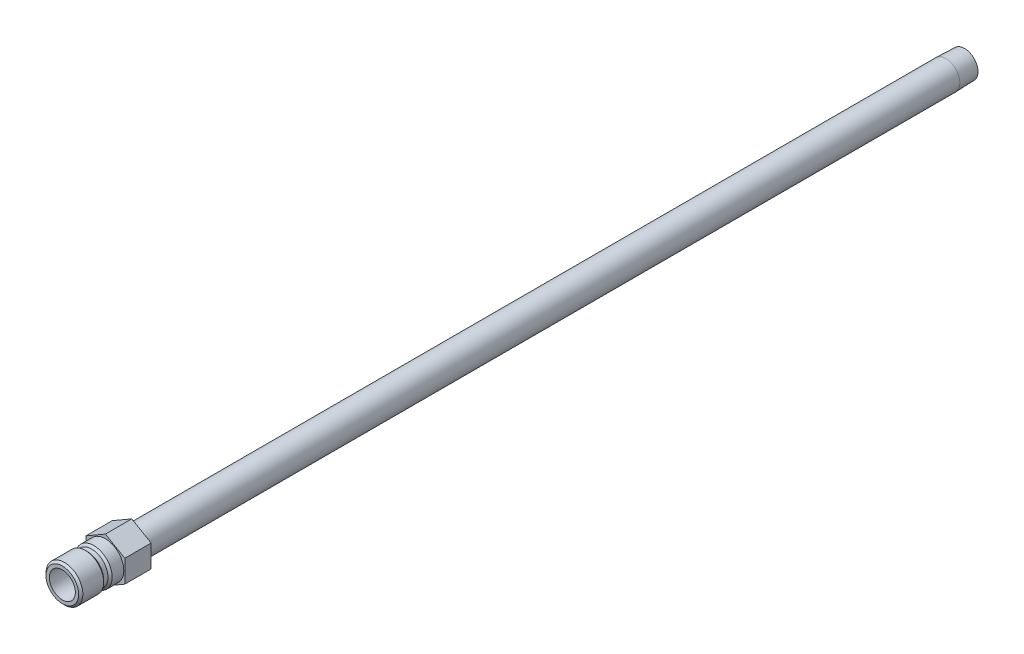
ISO-10303-21;
HEADER;
FILE_DESCRIPTION(('STEP AP214'),'2;1');
FILE_NAME('part.step','',(''),(''),'','','');
FILE_SCHEMA(('AUTOMOTIVE_DESIGN { 1 0 10303 214 1 1 1 1 }'));
ENDSEC;
DATA;
#1=APPLICATION_CONTEXT('core data for automotive mechanical design processes');
#2=APPLICATION_PROTOCOL_DEFINITION('international standard','automotive_design',2000,#1);
#3=PRODUCT_CONTEXT('',#1,'mechanical');
#4=PRODUCT('Part','Part','',(#3));
#5=PRODUCT_RELATED_PRODUCT_CATEGORY('part','',(#4));
#6=PRODUCT_DEFINITION_FORMATION('','',#4);
#7=PRODUCT_DEFINITION_CONTEXT('part definition',#1,'design');
#8=PRODUCT_DEFINITION('design','',#6,#7);
#9=PRODUCT_DEFINITION_SHAPE('','',#8);
#10=(LENGTH_UNIT() NAMED_UNIT(*) SI_UNIT(.MILLI.,.METRE.));
#11=(NAMED_UNIT(*) PLANE_ANGLE_UNIT() SI_UNIT($,.RADIAN.));
#12=(NAMED_UNIT(*) SI_UNIT($,.STERADIAN.) SOLID_ANGLE_UNIT());
#13=UNCERTAINTY_MEASURE_WITH_UNIT(LENGTH_MEASURE(1.E-05),#10,'distance_accuracy_value','');
#14=(GEOMETRIC_REPRESENTATION_CONTEXT(3) GLOBAL_UNCERTAINTY_ASSIGNED_CONTEXT((#13)) GLOBAL_UNIT_ASSIGNED_CONTEXT((#10,
#11,#12)) REPRESENTATION_CONTEXT('',''));
#15=CARTESIAN_POINT('',(0.,0.,0.));
#16=DIRECTION('',(0.,0.,1.));
#17=DIRECTION('',(1.,0.,0.));
#18=AXIS2_PLACEMENT_3D('',#15,#16,#17);
#19=CARTESIAN_POINT('',(0.,0.,-9.652));
#20=DIRECTION('',(0.,0.,-1.));
#21=DIRECTION('',(0.,1.,0.));
#22=AXIS2_PLACEMENT_3D('',#19,#20,#21);
#23=CYLINDRICAL_SURFACE('',#22,4.7625);
#24=CARTESIAN_POINT('',(0.,0.,3.556));
#25=DIRECTION('',(0.,0.,-1.));
#26=DIRECTION('',(0.,1.,0.));
#27=AXIS2_PLACEMENT_3D('',#24,#25,#26);
#28=CIRCLE('',#27,4.7625);
#29=CARTESIAN_POINT('',(0.,4.7625,3.556));
#30=VERTEX_POINT('',#29);
#31=EDGE_CURVE('E137',#30,#30,#28,.T.);
#32=ORIENTED_EDGE('',*,*,#31,.T.);
#33=EDGE_LOOP('',(#32));
#34=FACE_BOUND('',#33,.T.);
#35=CARTESIAN_POINT('',(0.,0.,15.748));
#36=DIRECTION('',(0.,0.,-1.));
#37=DIRECTION('',(0.,1.,0.));
#38=AXIS2_PLACEMENT_3D('',#35,#36,#37);
#39=CIRCLE('',#38,4.7625);
#40=CARTESIAN_POINT('',(0.,4.7625,15.748));
#41=VERTEX_POINT('',#40);
#42=EDGE_CURVE('E41',#41,#41,#39,.T.);
#43=ORIENTED_EDGE('',*,*,#42,.F.);
#44=EDGE_LOOP('',(#43));
#45=FACE_BOUND('',#44,.T.);
#46=ADVANCED_FACE('F33',(#34,#45),#23,.F.);
#47=CARTESIAN_POINT('',(0.,4.7625,15.748));
#48=DIRECTION('',(0.,0.,1.));
#49=DIRECTION('',(0.,-1.,0.));
#50=AXIS2_PLACEMENT_3D('',#47,#48,#49);
#51=PLANE('',#50);
#52=ORIENTED_EDGE('',*,*,#42,.T.);
#53=EDGE_LOOP('',(#52));
#54=FACE_BOUND('',#53,.T.);
#55=CARTESIAN_POINT('',(0.,0.,15.748));
#56=DIRECTION('',(0.,0.,-1.));
#57=DIRECTION('',(0.,1.,0.));
#58=AXIS2_PLACEMENT_3D('',#55,#56,#57);
#59=CIRCLE('',#58,5.9817);
#60=CARTESIAN_POINT('',(0.,5.9817,15.748));
#61=VERTEX_POINT('',#60);
#62=EDGE_CURVE('E175',#61,#61,#59,.T.);
#63=ORIENTED_EDGE('',*,*,#62,.F.);
#64=EDGE_LOOP('',(#63));
#65=FACE_BOUND('',#64,.T.);
#66=ADVANCED_FACE('F180',(#54,#65),#51,.T.);
#67=CARTESIAN_POINT('',(0.,0.,14.986));
#68=DIRECTION('',(0.,0.,-1.));
#69=DIRECTION('',(0.,1.,0.));
#70=AXIS2_PLACEMENT_3D('',#67,#68,#69);
#71=CONICAL_SURFACE('',#70,6.7437,0.785398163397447);
#72=ORIENTED_EDGE('',*,*,#62,.T.);
#73=EDGE_LOOP('',(#72));
#74=FACE_BOUND('',#73,.T.);
#75=CARTESIAN_POINT('',(0.,0.,14.986));
#76=DIRECTION('',(0.,0.,-1.));
#77=DIRECTION('',(0.,1.,0.));
#78=AXIS2_PLACEMENT_3D('',#75,#76,#77);
#79=CIRCLE('',#78,6.7437);
#80=CARTESIAN_POINT('',(0.,6.7437,14.986));
#81=VERTEX_POINT('',#80);
#82=EDGE_CURVE('E172',#81,#81,#79,.T.);
#83=ORIENTED_EDGE('',*,*,#82,.F.);
#84=EDGE_LOOP('',(#83));
#85=FACE_BOUND('',#84,.T.);
#86=ADVANCED_FACE('F188',(#74,#85),#71,.T.);
#87=CARTESIAN_POINT('',(0.,0.,-9.652));
#88=DIRECTION('',(0.,0.,-1.));
#89=DIRECTION('',(0.,1.,0.));
#90=AXIS2_PLACEMENT_3D('',#87,#88,#89);
#91=CYLINDRICAL_SURFACE('',#90,6.7437);
#92=ORIENTED_EDGE('',*,*,#82,.T.);
#93=EDGE_LOOP('',(#92));
#94=FACE_BOUND('',#93,.T.);
#95=CARTESIAN_POINT('',(0.,0.,7.366));
#96=DIRECTION('',(0.,0.,-1.));
#97=DIRECTION('',(0.,1.,0.));
#98=AXIS2_PLACEMENT_3D('',#95,#96,#97);
#99=CIRCLE('',#98,6.7437);
#100=CARTESIAN_POINT('',(0.,6.7437,7.366));
#101=VERTEX_POINT('',#100);
#102=EDGE_CURVE('E169',#101,#101,#99,.T.);
#103=ORIENTED_EDGE('',*,*,#102,.F.);
#104=EDGE_LOOP('',(#103));
#105=FACE_BOUND('',#104,.T.);
#106=ADVANCED_FACE('F237',(#94,#105),#91,.T.);
#107=CARTESIAN_POINT('',(0.,0.,6.604));
#108=DIRECTION('',(0.,0.,1.));
#109=DIRECTION('',(0.,-1.,0.));
#110=AXIS2_PLACEMENT_3D('',#107,#108,#109);
#111=CONICAL_SURFACE('',#110,5.9817,0.785398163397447);
#112=ORIENTED_EDGE('',*,*,#102,.T.);
#113=EDGE_LOOP('',(#112));
#114=FACE_BOUND('',#113,.T.);
#115=CARTESIAN_POINT('',(0.,0.,6.604));
#116=DIRECTION('',(0.,0.,-1.));
#117=DIRECTION('',(0.,1.,0.));
#118=AXIS2_PLACEMENT_3D('',#115,#116,#117);
#119=CIRCLE('',#118,5.9817);
#120=CARTESIAN_POINT('',(0.,5.9817,6.604));
#121=VERTEX_POINT('',#120);
#122=EDGE_CURVE('E166',#121,#121,#119,.T.);
#123=ORIENTED_EDGE('',*,*,#122,.F.);
#124=EDGE_LOOP('',(#123));
#125=FACE_BOUND('',#124,.T.);
#126=ADVANCED_FACE('F233',(#114,#125),#111,.T.);
#127=CARTESIAN_POINT('',(0.,0.,-9.652));
#128=DIRECTION('',(0.,0.,-1.));
#129=DIRECTION('',(0.,1.,0.));
#130=AXIS2_PLACEMENT_3D('',#127,#128,#129);
#131=CYLINDRICAL_SURFACE('',#130,5.9817);
#132=ORIENTED_EDGE('',*,*,#122,.T.);
#133=EDGE_LOOP('',(#132));
#134=FACE_BOUND('',#133,.T.);
#135=CARTESIAN_POINT('',(0.,0.,5.0165));
#136=DIRECTION('',(0.,0.,-1.));
#137=DIRECTION('',(0.,1.,0.));
#138=AXIS2_PLACEMENT_3D('',#135,#136,#137);
#139=CIRCLE('',#138,5.9817);
#140=CARTESIAN_POINT('',(0.,5.9817,5.0165));
#141=VERTEX_POINT('',#140);
#142=EDGE_CURVE('E163',#141,#141,#139,.T.);
#143=ORIENTED_EDGE('',*,*,#142,.F.);
#144=EDGE_LOOP('',(#143));
#145=FACE_BOUND('',#144,.T.);
#146=ADVANCED_FACE('F229',(#134,#145),#131,.T.);
#147=CARTESIAN_POINT('',(0.,0.,4.2545));
#148=DIRECTION('',(0.,0.,-1.));
#149=DIRECTION('',(0.,1.,0.));
#150=AXIS2_PLACEMENT_3D('',#147,#148,#149);
#151=CONICAL_SURFACE('',#150,6.7437,0.785398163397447);
#152=ORIENTED_EDGE('',*,*,#142,.T.);
#153=EDGE_LOOP('',(#152));
#154=FACE_BOUND('',#153,.T.);
#155=CARTESIAN_POINT('',(0.,0.,4.2545));
#156=DIRECTION('',(0.,0.,-1.));
#157=DIRECTION('',(0.,1.,0.));
#158=AXIS2_PLACEMENT_3D('',#155,#156,#157);
#159=CIRCLE('',#158,6.7437);
#160=CARTESIAN_POINT('',(0.,6.7437,4.2545));
#161=VERTEX_POINT('',#160);
#162=EDGE_CURVE('E160',#161,#161,#159,.T.);
#163=ORIENTED_EDGE('',*,*,#162,.F.);
#164=EDGE_LOOP('',(#163));
#165=FACE_BOUND('',#164,.T.);
#166=ADVANCED_FACE('F225',(#154,#165),#151,.T.);
#167=CARTESIAN_POINT('',(0.,0.,-9.652));
#168=DIRECTION('',(0.,0.,-1.));
#169=DIRECTION('',(0.,1.,0.));
#170=AXIS2_PLACEMENT_3D('',#167,#168,#169);
#171=CYLINDRICAL_SURFACE('',#170,6.7437);
#172=CARTESIAN_POINT('',(0.,0.,0.));
#173=DIRECTION('',(0.,0.,1.));
#174=DIRECTION('',(1.,0.,0.));
#175=AXIS2_PLACEMENT_3D('',#172,#173,#174);
#176=CIRCLE('',#175,6.7437);
#177=CARTESIAN_POINT('',(6.7437,0.,0.));
#178=VERTEX_POINT('',#177);
#179=EDGE_CURVE('E11',#178,#178,#176,.F.);
#180=ORIENTED_EDGE('',*,*,#179,.F.);
#181=EDGE_LOOP('',(#180));
#182=FACE_BOUND('',#181,.T.);
#183=ORIENTED_EDGE('',*,*,#162,.T.);
#184=EDGE_LOOP('',(#183));
#185=FACE_BOUND('',#184,.T.);
#186=ADVANCED_FACE('F221',(#182,#185),#171,.T.);
#187=CARTESIAN_POINT('',(0.,6.7437,-9.652));
#188=DIRECTION('',(0.,0.,-1.));
#189=DIRECTION('',(0.,1.,0.));
#190=AXIS2_PLACEMENT_3D('',#187,#188,#189);
#191=PLANE('',#190);
#192=CARTESIAN_POINT('',(0.,0.,-9.652));
#193=DIRECTION('',(0.,0.,-1.));
#194=DIRECTION('',(0.,1.,0.));
#195=AXIS2_PLACEMENT_3D('',#192,#193,#194);
#196=CIRCLE('',#195,5.1435);
#197=CARTESIAN_POINT('',(0.,5.1435,-9.652));
#198=VERTEX_POINT('',#197);
#199=EDGE_CURVE('E157',#198,#198,#196,.T.);
#200=ORIENTED_EDGE('',*,*,#199,.F.);
#201=EDGE_LOOP('',(#200));
#202=FACE_BOUND('',#201,.T.);
#203=DIRECTION('',(-0.866025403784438,-0.5,0.));
#204=VECTOR('',#203,1.);
#205=CARTESIAN_POINT('',(0.,8.21223022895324,-9.652));
#206=LINE('',#205,#204);
#207=CARTESIAN_POINT('',(0.,8.21223022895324,-9.652));
#208=VERTEX_POINT('',#207);
#209=CARTESIAN_POINT('',(-7.112,4.10611511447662,-9.652));
#210=VERTEX_POINT('',#209);
#211=EDGE_CURVE('E135',#208,#210,#206,.T.);
#212=ORIENTED_EDGE('',*,*,#211,.F.);
#213=DIRECTION('',(-0.866025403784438,0.5,0.));
#214=VECTOR('',#213,1.);
#215=CARTESIAN_POINT('',(7.112,4.10611511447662,-9.652));
#216=LINE('',#215,#214);
#217=CARTESIAN_POINT('',(7.112,4.10611511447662,-9.652));
#218=VERTEX_POINT('',#217);
#219=EDGE_CURVE('E110',#218,#208,#216,.T.);
#220=ORIENTED_EDGE('',*,*,#219,.F.);
#221=DIRECTION('',(0.,1.,0.));
#222=VECTOR('',#221,1.);
#223=CARTESIAN_POINT('',(7.112,-4.10611511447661,-9.652));
#224=LINE('',#223,#222);
#225=CARTESIAN_POINT('',(7.112,-4.10611511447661,-9.652));
#226=VERTEX_POINT('',#225);
#227=EDGE_CURVE('E95',#226,#218,#224,.T.);
#228=ORIENTED_EDGE('',*,*,#227,.F.);
#229=DIRECTION('',(0.866025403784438,0.5,0.));
#230=VECTOR('',#229,1.);
#231=CARTESIAN_POINT('',(0.,-8.21223022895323,-9.652));
#232=LINE('',#231,#230);
#233=CARTESIAN_POINT('',(0.,-8.21223022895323,-9.652));
#234=VERTEX_POINT('',#233);
#235=EDGE_CURVE('E108',#234,#226,#232,.T.);
#236=ORIENTED_EDGE('',*,*,#235,.F.);
#237=DIRECTION('',(0.866025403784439,-0.5,0.));
#238=VECTOR('',#237,1.);
#239=CARTESIAN_POINT('',(-7.112,-4.10611511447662,-9.652));
#240=LINE('',#239,#238);
#241=CARTESIAN_POINT('',(-7.112,-4.10611511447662,-9.652));
#242=VERTEX_POINT('',#241);
#243=EDGE_CURVE('E113',#242,#234,#240,.T.);
#244=ORIENTED_EDGE('',*,*,#243,.F.);
#245=DIRECTION('',(0.,-1.,0.));
#246=VECTOR('',#245,1.);
#247=CARTESIAN_POINT('',(-7.112,4.10611511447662,-9.652));
#248=LINE('',#247,#246);
#249=EDGE_CURVE('E115',#210,#242,#248,.T.);
#250=ORIENTED_EDGE('',*,*,#249,.F.);
#251=EDGE_LOOP('',(#212,#220,#228,#236,#244,#250));
#252=FACE_BOUND('',#251,.T.);
#253=ADVANCED_FACE('F106',(#202,#252),#191,.T.);
#254=CARTESIAN_POINT('',(0.,0.,-9.652));
#255=DIRECTION('',(0.,0.,-1.));
#256=DIRECTION('',(0.,1.,0.));
#257=AXIS2_PLACEMENT_3D('',#254,#255,#256);
#258=CYLINDRICAL_SURFACE('',#257,5.14349999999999);
#259=ORIENTED_EDGE('',*,*,#199,.T.);
#260=EDGE_LOOP('',(#259));
#261=FACE_BOUND('',#260,.T.);
#262=CARTESIAN_POINT('',(0.,0.,-307.594));
#263=DIRECTION('',(0.,0.,-1.));
#264=DIRECTION('',(0.,1.,0.));
#265=AXIS2_PLACEMENT_3D('',#262,#263,#264);
#266=CIRCLE('',#265,5.14349999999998);
#267=CARTESIAN_POINT('',(0.,5.1435,-307.594));
#268=VERTEX_POINT('',#267);
#269=EDGE_CURVE('E154',#268,#268,#266,.T.);
#270=ORIENTED_EDGE('',*,*,#269,.F.);
#271=EDGE_LOOP('',(#270));
#272=FACE_BOUND('',#271,.T.);
#273=ADVANCED_FACE('F214',(#261,#272),#258,.T.);
#274=CARTESIAN_POINT('',(0.,0.,-314.452));
#275=DIRECTION('',(0.,0.,1.));
#276=DIRECTION('',(0.,-1.,0.));
#277=AXIS2_PLACEMENT_3D('',#274,#275,#276);
#278=CONICAL_SURFACE('',#277,4.92918877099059,0.0312396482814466);
#279=ORIENTED_EDGE('',*,*,#269,.T.);
#280=EDGE_LOOP('',(#279));
#281=FACE_BOUND('',#280,.T.);
#282=CARTESIAN_POINT('',(0.,0.,-314.452));
#283=DIRECTION('',(0.,0.,-1.));
#284=DIRECTION('',(0.,1.,0.));
#285=AXIS2_PLACEMENT_3D('',#282,#283,#284);
#286=CIRCLE('',#285,4.92918877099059);
#287=CARTESIAN_POINT('',(0.,4.9291887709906,-314.452));
#288=VERTEX_POINT('',#287);
#289=EDGE_CURVE('E151',#288,#288,#286,.T.);
#290=ORIENTED_EDGE('',*,*,#289,.F.);
#291=EDGE_LOOP('',(#290));
#292=FACE_BOUND('',#291,.T.);
#293=ADVANCED_FACE('F210',(#281,#292),#278,.T.);
#294=CARTESIAN_POINT('',(0.,4.9291887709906,-314.452));
#295=DIRECTION('',(0.,0.,-1.));
#296=DIRECTION('',(0.,1.,0.));
#297=AXIS2_PLACEMENT_3D('',#294,#295,#296);
#298=PLANE('',#297);
#299=ORIENTED_EDGE('',*,*,#289,.T.);
#300=EDGE_LOOP('',(#299));
#301=FACE_BOUND('',#300,.T.);
#302=CARTESIAN_POINT('',(0.,0.,-314.452));
#303=DIRECTION('',(0.,0.,-1.));
#304=DIRECTION('',(0.,1.,0.));
#305=AXIS2_PLACEMENT_3D('',#302,#303,#304);
#306=CIRCLE('',#305,3.41629999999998);
#307=CARTESIAN_POINT('',(0.,3.4163,-314.452));
#308=VERTEX_POINT('',#307);
#309=EDGE_CURVE('E148',#308,#308,#306,.T.);
#310=ORIENTED_EDGE('',*,*,#309,.F.);
#311=EDGE_LOOP('',(#310));
#312=FACE_BOUND('',#311,.T.);
#313=ADVANCED_FACE('F203',(#301,#312),#298,.T.);
#314=CARTESIAN_POINT('',(0.,0.,-9.652));
#315=DIRECTION('',(0.,0.,-1.));
#316=DIRECTION('',(0.,1.,0.));
#317=AXIS2_PLACEMENT_3D('',#314,#315,#316);
#318=CYLINDRICAL_SURFACE('',#317,3.41629999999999);
#319=ORIENTED_EDGE('',*,*,#309,.T.);
#320=EDGE_LOOP('',(#319));
#321=FACE_BOUND('',#320,.T.);
#322=CARTESIAN_POINT('',(0.,0.,2.84021276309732));
#323=DIRECTION('',(0.,0.,-1.));
#324=DIRECTION('',(0.,1.,0.));
#325=AXIS2_PLACEMENT_3D('',#322,#323,#324);
#326=CIRCLE('',#325,3.4163);
#327=CARTESIAN_POINT('',(0.,3.4163,2.84021276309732));
#328=VERTEX_POINT('',#327);
#329=EDGE_CURVE('E145',#328,#328,#326,.T.);
#330=ORIENTED_EDGE('',*,*,#329,.F.);
#331=EDGE_LOOP('',(#330));
#332=FACE_BOUND('',#331,.T.);
#333=ADVANCED_FACE('F194',(#321,#332),#318,.F.);
#334=CARTESIAN_POINT('',(0.,0.,3.556));
#335=DIRECTION('',(0.,0.,1.));
#336=DIRECTION('',(0.,-1.,0.));
#337=AXIS2_PLACEMENT_3D('',#334,#335,#336);
#338=CONICAL_SURFACE('',#337,4.7625,1.08210413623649);
#339=ORIENTED_EDGE('',*,*,#329,.T.);
#340=EDGE_LOOP('',(#339));
#341=FACE_BOUND('',#340,.T.);
#342=ORIENTED_EDGE('',*,*,#31,.F.);
#343=EDGE_LOOP('',(#342));
#344=FACE_BOUND('',#343,.T.);
#345=ADVANCED_FACE('F191',(#341,#344),#338,.F.);
#346=CARTESIAN_POINT('',(0.,8.21223022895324,-9.652));
#347=DIRECTION('',(-0.5,0.866025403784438,0.));
#348=DIRECTION('',(-0.866025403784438,-0.5,0.));
#349=AXIS2_PLACEMENT_3D('',#346,#347,#348);
#350=PLANE('',#349);
#351=DIRECTION('',(-0.866025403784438,-0.5,0.));
#352=VECTOR('',#351,1.);
#353=CARTESIAN_POINT('',(0.,8.21223022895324,0.));
#354=LINE('',#353,#352);
#355=CARTESIAN_POINT('',(0.,8.21223022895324,0.));
#356=VERTEX_POINT('',#355);
#357=CARTESIAN_POINT('',(-7.112,4.10611511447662,0.));
#358=VERTEX_POINT('',#357);
#359=EDGE_CURVE('E120',#356,#358,#354,.T.);
#360=ORIENTED_EDGE('',*,*,#359,.F.);
#361=DIRECTION('',(0.,0.,1.));
#362=VECTOR('',#361,1.);
#363=CARTESIAN_POINT('',(0.,8.21223022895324,-9.652));
#364=LINE('',#363,#362);
#365=EDGE_CURVE('E49',#208,#356,#364,.T.);
#366=ORIENTED_EDGE('',*,*,#365,.F.);
#367=ORIENTED_EDGE('',*,*,#211,.T.);
#368=DIRECTION('',(0.,0.,1.));
#369=VECTOR('',#368,1.);
#370=CARTESIAN_POINT('',(-7.112,4.10611511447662,-9.652));
#371=LINE('',#370,#369);
#372=EDGE_CURVE('E84',#210,#358,#371,.T.);
#373=ORIENTED_EDGE('',*,*,#372,.T.);
#374=EDGE_LOOP('',(#360,#366,#367,#373));
#375=FACE_BOUND('',#374,.T.);
#376=ADVANCED_FACE('F193',(#375),#350,.T.);
#377=CARTESIAN_POINT('',(7.112,4.10611511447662,-9.652));
#378=DIRECTION('',(0.5,0.866025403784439,0.));
#379=DIRECTION('',(-0.866025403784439,0.5,0.));
#380=AXIS2_PLACEMENT_3D('',#377,#378,#379);
#381=PLANE('',#380);
#382=DIRECTION('',(-0.866025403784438,0.5,0.));
#383=VECTOR('',#382,1.);
#384=CARTESIAN_POINT('',(7.112,4.10611511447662,0.));
#385=LINE('',#384,#383);
#386=CARTESIAN_POINT('',(7.112,4.10611511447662,0.));
#387=VERTEX_POINT('',#386);
#388=EDGE_CURVE('E132',#387,#356,#385,.T.);
#389=ORIENTED_EDGE('',*,*,#388,.F.);
#390=DIRECTION('',(0.,0.,1.));
#391=VECTOR('',#390,1.);
#392=CARTESIAN_POINT('',(7.112,4.10611511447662,-9.652));
#393=LINE('',#392,#391);
#394=EDGE_CURVE('E72',#218,#387,#393,.T.);
#395=ORIENTED_EDGE('',*,*,#394,.F.);
#396=ORIENTED_EDGE('',*,*,#219,.T.);
#397=ORIENTED_EDGE('',*,*,#365,.T.);
#398=EDGE_LOOP('',(#389,#395,#396,#397));
#399=FACE_BOUND('',#398,.T.);
#400=ADVANCED_FACE('F201',(#399),#381,.T.);
#401=CARTESIAN_POINT('',(7.112,-4.10611511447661,-9.652));
#402=DIRECTION('',(1.,0.,0.));
#403=DIRECTION('',(0.,1.,0.));
#404=AXIS2_PLACEMENT_3D('',#401,#402,#403);
#405=PLANE('',#404);
#406=DIRECTION('',(0.,1.,0.));
#407=VECTOR('',#406,1.);
#408=CARTESIAN_POINT('',(7.112,-4.10611511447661,0.));
#409=LINE('',#408,#407);
#410=CARTESIAN_POINT('',(7.112,-4.10611511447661,0.));
#411=VERTEX_POINT('',#410);
#412=EDGE_CURVE('E97',#411,#387,#409,.T.);
#413=ORIENTED_EDGE('',*,*,#412,.F.);
#414=DIRECTION('',(0.,0.,1.));
#415=VECTOR('',#414,1.);
#416=CARTESIAN_POINT('',(7.112,-4.10611511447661,-9.652));
#417=LINE('',#416,#415);
#418=EDGE_CURVE('E92',#226,#411,#417,.T.);
#419=ORIENTED_EDGE('',*,*,#418,.F.);
#420=ORIENTED_EDGE('',*,*,#227,.T.);
#421=ORIENTED_EDGE('',*,*,#394,.T.);
#422=EDGE_LOOP('',(#413,#419,#420,#421));
#423=FACE_BOUND('',#422,.T.);
#424=ADVANCED_FACE('F94',(#423),#405,.T.);
#425=CARTESIAN_POINT('',(0.,-8.21223022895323,-9.652));
#426=DIRECTION('',(0.5,-0.866025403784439,0.));
#427=DIRECTION('',(0.866025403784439,0.5,0.));
#428=AXIS2_PLACEMENT_3D('',#425,#426,#427);
#429=PLANE('',#428);
#430=DIRECTION('',(0.866025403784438,0.5,0.));
#431=VECTOR('',#430,1.);
#432=CARTESIAN_POINT('',(0.,-8.21223022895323,0.));
#433=LINE('',#432,#431);
#434=CARTESIAN_POINT('',(0.,-8.21223022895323,0.));
#435=VERTEX_POINT('',#434);
#436=EDGE_CURVE('E129',#435,#411,#433,.T.);
#437=ORIENTED_EDGE('',*,*,#436,.F.);
#438=DIRECTION('',(0.,0.,1.));
#439=VECTOR('',#438,1.);
#440=CARTESIAN_POINT('',(0.,-8.21223022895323,-9.652));
#441=LINE('',#440,#439);
#442=EDGE_CURVE('E102',#234,#435,#441,.T.);
#443=ORIENTED_EDGE('',*,*,#442,.F.);
#444=ORIENTED_EDGE('',*,*,#235,.T.);
#445=ORIENTED_EDGE('',*,*,#418,.T.);
#446=EDGE_LOOP('',(#437,#443,#444,#445));
#447=FACE_BOUND('',#446,.T.);
#448=ADVANCED_FACE('F112',(#447),#429,.T.);
#449=CARTESIAN_POINT('',(-7.112,-4.10611511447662,-9.652));
#450=DIRECTION('',(-0.5,-0.866025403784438,0.));
#451=DIRECTION('',(0.866025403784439,-0.5,0.));
#452=AXIS2_PLACEMENT_3D('',#449,#450,#451);
#453=PLANE('',#452);
#454=DIRECTION('',(0.866025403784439,-0.5,0.));
#455=VECTOR('',#454,1.);
#456=CARTESIAN_POINT('',(-7.112,-4.10611511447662,0.));
#457=LINE('',#456,#455);
#458=CARTESIAN_POINT('',(-7.112,-4.10611511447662,0.));
#459=VERTEX_POINT('',#458);
#460=EDGE_CURVE('E126',#459,#435,#457,.T.);
#461=ORIENTED_EDGE('',*,*,#460,.F.);
#462=DIRECTION('',(0.,0.,1.));
#463=VECTOR('',#462,1.);
#464=CARTESIAN_POINT('',(-7.112,-4.10611511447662,-9.652));
#465=LINE('',#464,#463);
#466=EDGE_CURVE('E140',#242,#459,#465,.T.);
#467=ORIENTED_EDGE('',*,*,#466,.F.);
#468=ORIENTED_EDGE('',*,*,#243,.T.);
#469=ORIENTED_EDGE('',*,*,#442,.T.);
#470=EDGE_LOOP('',(#461,#467,#468,#469));
#471=FACE_BOUND('',#470,.T.);
#472=ADVANCED_FACE('F338',(#471),#453,.T.);
#473=CARTESIAN_POINT('',(-7.112,4.10611511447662,-9.652));
#474=DIRECTION('',(-1.,0.,0.));
#475=DIRECTION('',(0.,-1.,0.));
#476=AXIS2_PLACEMENT_3D('',#473,#474,#475);
#477=PLANE('',#476);
#478=DIRECTION('',(0.,-1.,0.));
#479=VECTOR('',#478,1.);
#480=CARTESIAN_POINT('',(-7.112,4.10611511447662,0.));
#481=LINE('',#480,#479);
#482=EDGE_CURVE('E123',#358,#459,#481,.T.);
#483=ORIENTED_EDGE('',*,*,#482,.F.);
#484=ORIENTED_EDGE('',*,*,#372,.F.);
#485=ORIENTED_EDGE('',*,*,#249,.T.);
#486=ORIENTED_EDGE('',*,*,#466,.T.);
#487=EDGE_LOOP('',(#483,#484,#485,#486));
#488=FACE_BOUND('',#487,.T.);
#489=ADVANCED_FACE('F346',(#488),#477,.T.);
#490=CARTESIAN_POINT('',(-7.112,4.10611511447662,0.));
#491=DIRECTION('',(0.,0.,1.));
#492=DIRECTION('',(1.,0.,0.));
#493=AXIS2_PLACEMENT_3D('',#490,#491,#492);
#494=PLANE('',#493);
#495=ORIENTED_EDGE('',*,*,#179,.T.);
#496=EDGE_LOOP('',(#495));
#497=FACE_BOUND('',#496,.T.);
#498=ORIENTED_EDGE('',*,*,#359,.T.);
#499=ORIENTED_EDGE('',*,*,#482,.T.);
#500=ORIENTED_EDGE('',*,*,#460,.T.);
#501=ORIENTED_EDGE('',*,*,#436,.T.);
#502=ORIENTED_EDGE('',*,*,#412,.T.);
#503=ORIENTED_EDGE('',*,*,#388,.T.);
#504=EDGE_LOOP('',(#498,#499,#500,#501,#502,#503));
#505=FACE_BOUND('',#504,.T.);
#506=ADVANCED_FACE('F355',(#497,#505),#494,.T.);
#507=CLOSED_SHELL('',(#46,#66,#86,#106,#126,#146,#166,#186,#253,#273,#293,#313,#333,#345,#376,
#400,#424,#448,#472,#489,#506));
#508=MANIFOLD_SOLID_BREP('B2',#507);
#509=ADVANCED_BREP_SHAPE_REPRESENTATION('',(#18,#508),#14);
#510=SHAPE_DEFINITION_REPRESENTATION(#9,#509);
ENDSEC;
END-ISO-10303-21;
